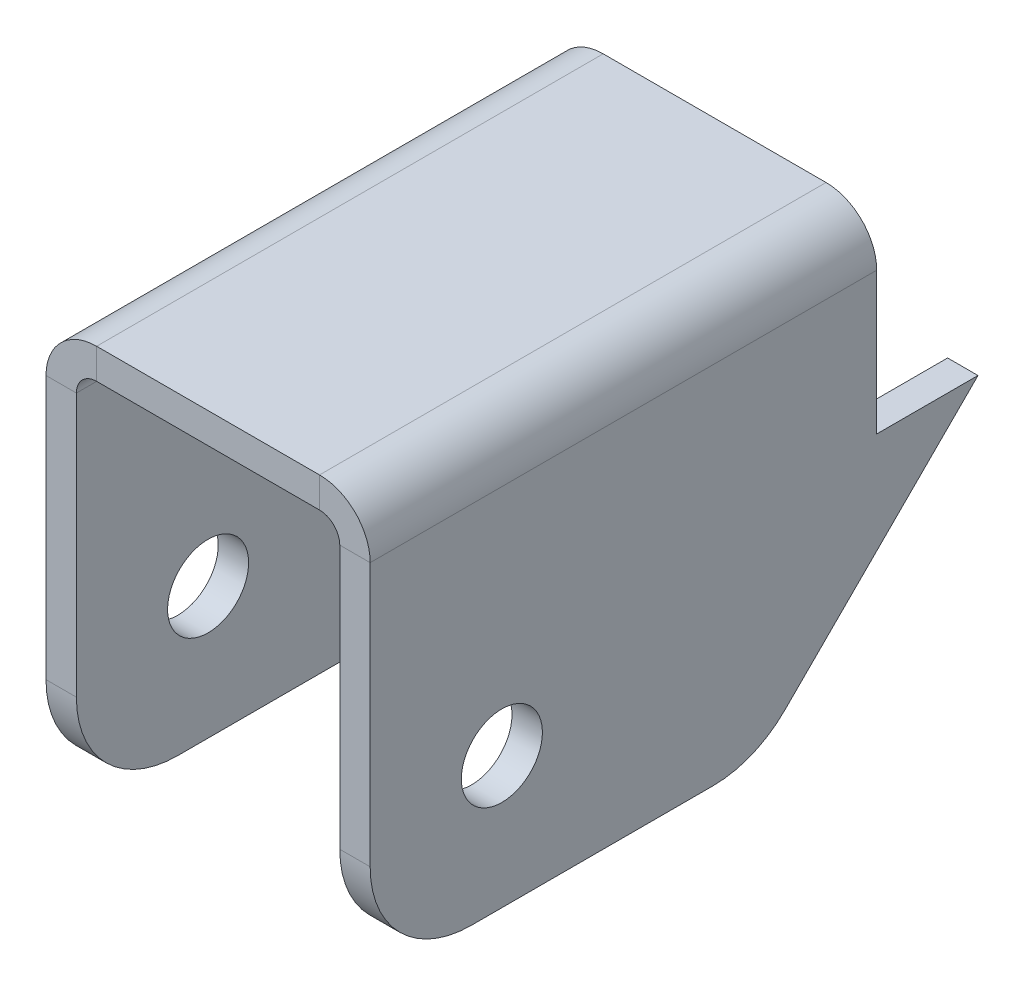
ISO-10303-21;
HEADER;
FILE_DESCRIPTION(('STEP AP214'),'2;1');
FILE_NAME('part.step','',(''),(''),'','','');
FILE_SCHEMA(('AUTOMOTIVE_DESIGN { 1 0 10303 214 1 1 1 1 }'));
ENDSEC;
DATA;
#1=APPLICATION_CONTEXT('core data for automotive mechanical design processes');
#2=APPLICATION_PROTOCOL_DEFINITION('international standard','automotive_design',2000,#1);
#3=PRODUCT_CONTEXT('',#1,'mechanical');
#4=PRODUCT('Part','Part','',(#3));
#5=PRODUCT_RELATED_PRODUCT_CATEGORY('part','',(#4));
#6=PRODUCT_DEFINITION_FORMATION('','',#4);
#7=PRODUCT_DEFINITION_CONTEXT('part definition',#1,'design');
#8=PRODUCT_DEFINITION('design','',#6,#7);
#9=PRODUCT_DEFINITION_SHAPE('','',#8);
#10=(LENGTH_UNIT() NAMED_UNIT(*) SI_UNIT(.MILLI.,.METRE.));
#11=(NAMED_UNIT(*) PLANE_ANGLE_UNIT() SI_UNIT($,.RADIAN.));
#12=(NAMED_UNIT(*) SI_UNIT($,.STERADIAN.) SOLID_ANGLE_UNIT());
#13=UNCERTAINTY_MEASURE_WITH_UNIT(LENGTH_MEASURE(1.E-05),#10,'distance_accuracy_value','');
#14=(GEOMETRIC_REPRESENTATION_CONTEXT(3) GLOBAL_UNCERTAINTY_ASSIGNED_CONTEXT((#13)) GLOBAL_UNIT_ASSIGNED_CONTEXT((#10,
#11,#12)) REPRESENTATION_CONTEXT('',''));
#15=CARTESIAN_POINT('',(0.,0.,0.));
#16=DIRECTION('',(0.,0.,1.));
#17=DIRECTION('',(1.,0.,0.));
#18=AXIS2_PLACEMENT_3D('',#15,#16,#17);
#19=CARTESIAN_POINT('',(13.,0.,60.));
#20=DIRECTION('',(1.,0.,0.));
#21=DIRECTION('',(0.,0.,-1.));
#22=AXIS2_PLACEMENT_3D('',#19,#20,#21);
#23=PLANE('',#22);
#24=CARTESIAN_POINT('',(13.,-28.,47.));
#25=DIRECTION('',(1.,0.,0.));
#26=DIRECTION('',(0.,0.,-1.));
#27=AXIS2_PLACEMENT_3D('',#24,#25,#26);
#28=CIRCLE('',#27,4.00000000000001);
#29=CARTESIAN_POINT('',(13.,-28.,43.));
#30=VERTEX_POINT('',#29);
#31=EDGE_CURVE('E366',#30,#30,#28,.T.);
#32=ORIENTED_EDGE('',*,*,#31,.T.);
#33=EDGE_LOOP('',(#32));
#34=FACE_BOUND('',#33,.T.);
#35=DIRECTION('',(0.,-0.707106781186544,0.707106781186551));
#36=VECTOR('',#35,1.);
#37=CARTESIAN_POINT('',(13.,-39.5000000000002,20.5000000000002));
#38=LINE('',#37,#36);
#39=CARTESIAN_POINT('',(13.,-19.,0.));
#40=VERTEX_POINT('',#39);
#41=CARTESIAN_POINT('',(13.,-38.0710678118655,19.0710678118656));
#42=VERTEX_POINT('',#41);
#43=EDGE_CURVE('E183',#40,#42,#38,.T.);
#44=ORIENTED_EDGE('',*,*,#43,.T.);
#45=CARTESIAN_POINT('',(13.,-31.,26.142135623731));
#46=DIRECTION('',(1.,0.,0.));
#47=DIRECTION('',(0.,0.,-1.));
#48=AXIS2_PLACEMENT_3D('',#45,#46,#47);
#49=CIRCLE('',#48,10.);
#50=CARTESIAN_POINT('',(13.,-41.,26.142135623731));
#51=VERTEX_POINT('',#50);
#52=EDGE_CURVE('E348',#42,#51,#49,.F.);
#53=ORIENTED_EDGE('',*,*,#52,.T.);
#54=DIRECTION('',(0.,0.,-1.));
#55=VECTOR('',#54,1.);
#56=CARTESIAN_POINT('',(13.,-41.,60.));
#57=LINE('',#56,#55);
#58=CARTESIAN_POINT('',(13.,-41.,50.));
#59=VERTEX_POINT('',#58);
#60=EDGE_CURVE('E301',#59,#51,#57,.T.);
#61=ORIENTED_EDGE('',*,*,#60,.F.);
#62=CARTESIAN_POINT('',(13.,-31.,50.));
#63=DIRECTION('',(1.,0.,0.));
#64=DIRECTION('',(0.,0.,-1.));
#65=AXIS2_PLACEMENT_3D('',#62,#63,#64);
#66=CIRCLE('',#65,10.);
#67=CARTESIAN_POINT('',(13.,-31.,60.));
#68=VERTEX_POINT('',#67);
#69=EDGE_CURVE('E325',#59,#68,#66,.F.);
#70=ORIENTED_EDGE('',*,*,#69,.T.);
#71=DIRECTION('',(0.,1.,0.));
#72=VECTOR('',#71,1.);
#73=CARTESIAN_POINT('',(13.,0.,60.));
#74=LINE('',#73,#72);
#75=CARTESIAN_POINT('',(13.,-4.99999999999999,60.));
#76=VERTEX_POINT('',#75);
#77=EDGE_CURVE('E243',#76,#68,#74,.F.);
#78=ORIENTED_EDGE('',*,*,#77,.F.);
#79=DIRECTION('',(0.,0.,-1.));
#80=VECTOR('',#79,1.);
#81=CARTESIAN_POINT('',(13.,-4.99999999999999,60.));
#82=LINE('',#81,#80);
#83=CARTESIAN_POINT('',(13.,-4.99999999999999,10.));
#84=VERTEX_POINT('',#83);
#85=EDGE_CURVE('E271',#76,#84,#82,.T.);
#86=ORIENTED_EDGE('',*,*,#85,.T.);
#87=DIRECTION('',(0.,-1.,0.));
#88=VECTOR('',#87,1.);
#89=CARTESIAN_POINT('',(13.,0.,10.));
#90=LINE('',#89,#88);
#91=CARTESIAN_POINT('',(13.,-19.,10.));
#92=VERTEX_POINT('',#91);
#93=EDGE_CURVE('E234',#84,#92,#90,.T.);
#94=ORIENTED_EDGE('',*,*,#93,.T.);
#95=DIRECTION('',(0.,0.,-1.));
#96=VECTOR('',#95,1.);
#97=CARTESIAN_POINT('',(13.,-19.,60.));
#98=LINE('',#97,#96);
#99=EDGE_CURVE('E223',#92,#40,#98,.T.);
#100=ORIENTED_EDGE('',*,*,#99,.T.);
#101=EDGE_LOOP('',(#44,#53,#61,#70,#78,#86,#94,#100));
#102=FACE_BOUND('',#101,.T.);
#103=ADVANCED_FACE('F39',(#34,#102),#23,.F.);
#104=CARTESIAN_POINT('',(16.,-41.,60.));
#105=DIRECTION('',(0.,-1.,0.));
#106=DIRECTION('',(0.,0.,-1.));
#107=AXIS2_PLACEMENT_3D('',#104,#105,#106);
#108=PLANE('',#107);
#109=ORIENTED_EDGE('',*,*,#60,.T.);
#110=DIRECTION('',(-1.,0.,0.));
#111=VECTOR('',#110,1.);
#112=CARTESIAN_POINT('',(16.,-41.,26.142135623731));
#113=LINE('',#112,#111);
#114=CARTESIAN_POINT('',(16.,-41.,26.142135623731));
#115=VERTEX_POINT('',#114);
#116=EDGE_CURVE('E342',#51,#115,#113,.F.);
#117=ORIENTED_EDGE('',*,*,#116,.T.);
#118=DIRECTION('',(0.,0.,-1.));
#119=VECTOR('',#118,1.);
#120=CARTESIAN_POINT('',(16.,-41.,60.));
#121=LINE('',#120,#119);
#122=CARTESIAN_POINT('',(16.,-41.,50.));
#123=VERTEX_POINT('',#122);
#124=EDGE_CURVE('E299',#123,#115,#121,.T.);
#125=ORIENTED_EDGE('',*,*,#124,.F.);
#126=DIRECTION('',(-1.,0.,0.));
#127=VECTOR('',#126,1.);
#128=CARTESIAN_POINT('',(16.,-41.,50.));
#129=LINE('',#128,#127);
#130=EDGE_CURVE('E322',#123,#59,#129,.T.);
#131=ORIENTED_EDGE('',*,*,#130,.T.);
#132=EDGE_LOOP('',(#109,#117,#125,#131));
#133=FACE_BOUND('',#132,.T.);
#134=ADVANCED_FACE('F396',(#133),#108,.T.);
#135=CARTESIAN_POINT('',(16.,0.,60.));
#136=DIRECTION('',(1.,0.,0.));
#137=DIRECTION('',(0.,0.,-1.));
#138=AXIS2_PLACEMENT_3D('',#135,#136,#137);
#139=PLANE('',#138);
#140=CARTESIAN_POINT('',(16.,-28.,47.));
#141=DIRECTION('',(-1.,0.,0.));
#142=DIRECTION('',(0.,-1.,0.));
#143=AXIS2_PLACEMENT_3D('',#140,#141,#142);
#144=CIRCLE('',#143,4.00000000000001);
#145=CARTESIAN_POINT('',(16.,-32.,47.));
#146=VERTEX_POINT('',#145);
#147=EDGE_CURVE('E373',#146,#146,#144,.T.);
#148=ORIENTED_EDGE('',*,*,#147,.T.);
#149=EDGE_LOOP('',(#148));
#150=FACE_BOUND('',#149,.T.);
#151=ORIENTED_EDGE('',*,*,#124,.T.);
#152=CARTESIAN_POINT('',(16.,-31.,26.142135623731));
#153=DIRECTION('',(1.,0.,0.));
#154=DIRECTION('',(0.,0.,-1.));
#155=AXIS2_PLACEMENT_3D('',#152,#153,#154);
#156=CIRCLE('',#155,10.);
#157=CARTESIAN_POINT('',(16.,-38.0710678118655,19.0710678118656));
#158=VERTEX_POINT('',#157);
#159=EDGE_CURVE('E196',#115,#158,#156,.T.);
#160=ORIENTED_EDGE('',*,*,#159,.T.);
#161=DIRECTION('',(0.,-0.707106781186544,0.707106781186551));
#162=VECTOR('',#161,1.);
#163=CARTESIAN_POINT('',(16.,-39.5000000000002,20.5000000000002));
#164=LINE('',#163,#162);
#165=CARTESIAN_POINT('',(16.,-19.,0.));
#166=VERTEX_POINT('',#165);
#167=EDGE_CURVE('E180',#166,#158,#164,.T.);
#168=ORIENTED_EDGE('',*,*,#167,.F.);
#169=DIRECTION('',(0.,0.,1.));
#170=VECTOR('',#169,1.);
#171=CARTESIAN_POINT('',(16.,-19.,0.));
#172=LINE('',#171,#170);
#173=CARTESIAN_POINT('',(16.,-19.,10.));
#174=VERTEX_POINT('',#173);
#175=EDGE_CURVE('E195',#166,#174,#172,.T.);
#176=ORIENTED_EDGE('',*,*,#175,.T.);
#177=DIRECTION('',(0.,1.,0.));
#178=VECTOR('',#177,1.);
#179=CARTESIAN_POINT('',(16.,0.,10.));
#180=LINE('',#179,#178);
#181=CARTESIAN_POINT('',(16.,-4.99999999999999,10.));
#182=VERTEX_POINT('',#181);
#183=EDGE_CURVE('E203',#174,#182,#180,.T.);
#184=ORIENTED_EDGE('',*,*,#183,.T.);
#185=DIRECTION('',(0.,0.,-1.));
#186=VECTOR('',#185,1.);
#187=CARTESIAN_POINT('',(16.,-4.99999999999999,60.));
#188=LINE('',#187,#186);
#189=CARTESIAN_POINT('',(16.,-4.99999999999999,60.));
#190=VERTEX_POINT('',#189);
#191=EDGE_CURVE('E296',#190,#182,#188,.T.);
#192=ORIENTED_EDGE('',*,*,#191,.F.);
#193=DIRECTION('',(0.,-1.,0.));
#194=VECTOR('',#193,1.);
#195=CARTESIAN_POINT('',(16.,0.,60.));
#196=LINE('',#195,#194);
#197=CARTESIAN_POINT('',(16.,-31.,60.));
#198=VERTEX_POINT('',#197);
#199=EDGE_CURVE('E246',#190,#198,#196,.T.);
#200=ORIENTED_EDGE('',*,*,#199,.T.);
#201=CARTESIAN_POINT('',(16.,-31.,50.));
#202=DIRECTION('',(1.,0.,0.));
#203=DIRECTION('',(0.,0.,-1.));
#204=AXIS2_PLACEMENT_3D('',#201,#202,#203);
#205=CIRCLE('',#204,10.);
#206=EDGE_CURVE('E329',#198,#123,#205,.T.);
#207=ORIENTED_EDGE('',*,*,#206,.T.);
#208=EDGE_LOOP('',(#151,#160,#168,#176,#184,#192,#200,#207));
#209=FACE_BOUND('',#208,.T.);
#210=ADVANCED_FACE('F193',(#150,#209),#139,.T.);
#211=CARTESIAN_POINT('',(-16.,-41.,60.));
#212=DIRECTION('',(-1.,0.,0.));
#213=DIRECTION('',(0.,-1.,0.));
#214=AXIS2_PLACEMENT_3D('',#211,#212,#213);
#215=PLANE('',#214);
#216=CARTESIAN_POINT('',(-16.,-28.,47.));
#217=DIRECTION('',(-1.,0.,0.));
#218=DIRECTION('',(0.,-1.,0.));
#219=AXIS2_PLACEMENT_3D('',#216,#217,#218);
#220=CIRCLE('',#219,4.00000000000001);
#221=CARTESIAN_POINT('',(-16.,-32.,47.));
#222=VERTEX_POINT('',#221);
#223=EDGE_CURVE('E370',#222,#222,#220,.T.);
#224=ORIENTED_EDGE('',*,*,#223,.F.);
#225=EDGE_LOOP('',(#224));
#226=FACE_BOUND('',#225,.T.);
#227=DIRECTION('',(0.,0.707106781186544,-0.707106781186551));
#228=VECTOR('',#227,1.);
#229=CARTESIAN_POINT('',(-16.,-60.,41.0000000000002));
#230=LINE('',#229,#228);
#231=CARTESIAN_POINT('',(-16.,-38.0710678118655,19.0710678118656));
#232=VERTEX_POINT('',#231);
#233=CARTESIAN_POINT('',(-16.,-19.,0.));
#234=VERTEX_POINT('',#233);
#235=EDGE_CURVE('E214',#232,#234,#230,.T.);
#236=ORIENTED_EDGE('',*,*,#235,.F.);
#237=CARTESIAN_POINT('',(-16.,-31.,26.142135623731));
#238=DIRECTION('',(-1.,0.,0.));
#239=DIRECTION('',(0.,-1.,0.));
#240=AXIS2_PLACEMENT_3D('',#237,#238,#239);
#241=CIRCLE('',#240,10.);
#242=CARTESIAN_POINT('',(-16.,-41.,26.142135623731));
#243=VERTEX_POINT('',#242);
#244=EDGE_CURVE('E62',#232,#243,#241,.T.);
#245=ORIENTED_EDGE('',*,*,#244,.T.);
#246=DIRECTION('',(0.,0.,-1.));
#247=VECTOR('',#246,1.);
#248=CARTESIAN_POINT('',(-16.,-41.,60.));
#249=LINE('',#248,#247);
#250=CARTESIAN_POINT('',(-16.,-41.,50.));
#251=VERTEX_POINT('',#250);
#252=EDGE_CURVE('E285',#251,#243,#249,.T.);
#253=ORIENTED_EDGE('',*,*,#252,.F.);
#254=CARTESIAN_POINT('',(-16.,-31.,50.));
#255=DIRECTION('',(-1.,0.,0.));
#256=DIRECTION('',(0.,-1.,0.));
#257=AXIS2_PLACEMENT_3D('',#254,#255,#256);
#258=CIRCLE('',#257,10.);
#259=CARTESIAN_POINT('',(-16.,-31.,60.));
#260=VERTEX_POINT('',#259);
#261=EDGE_CURVE('E316',#251,#260,#258,.T.);
#262=ORIENTED_EDGE('',*,*,#261,.T.);
#263=DIRECTION('',(0.,1.,0.));
#264=VECTOR('',#263,1.);
#265=CARTESIAN_POINT('',(-16.,-41.,60.));
#266=LINE('',#265,#264);
#267=CARTESIAN_POINT('',(-16.,-4.99999999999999,60.));
#268=VERTEX_POINT('',#267);
#269=EDGE_CURVE('E258',#260,#268,#266,.T.);
#270=ORIENTED_EDGE('',*,*,#269,.T.);
#271=DIRECTION('',(0.,0.,-1.));
#272=VECTOR('',#271,1.);
#273=CARTESIAN_POINT('',(-16.,-4.99999999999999,60.));
#274=LINE('',#273,#272);
#275=CARTESIAN_POINT('',(-16.,-4.99999999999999,10.));
#276=VERTEX_POINT('',#275);
#277=EDGE_CURVE('E287',#268,#276,#274,.T.);
#278=ORIENTED_EDGE('',*,*,#277,.T.);
#279=DIRECTION('',(0.,1.,0.));
#280=VECTOR('',#279,1.);
#281=CARTESIAN_POINT('',(-16.,0.,10.));
#282=LINE('',#281,#280);
#283=CARTESIAN_POINT('',(-16.,-19.,10.));
#284=VERTEX_POINT('',#283);
#285=EDGE_CURVE('E204',#284,#276,#282,.T.);
#286=ORIENTED_EDGE('',*,*,#285,.F.);
#287=DIRECTION('',(0.,0.,1.));
#288=VECTOR('',#287,1.);
#289=CARTESIAN_POINT('',(-16.,-19.,0.));
#290=LINE('',#289,#288);
#291=EDGE_CURVE('E208',#234,#284,#290,.T.);
#292=ORIENTED_EDGE('',*,*,#291,.F.);
#293=EDGE_LOOP('',(#236,#245,#253,#262,#270,#278,#286,#292));
#294=FACE_BOUND('',#293,.T.);
#295=ADVANCED_FACE('F363',(#226,#294),#215,.T.);
#296=CARTESIAN_POINT('',(-13.,-41.,60.));
#297=DIRECTION('',(0.,-1.,0.));
#298=DIRECTION('',(0.,0.,-1.));
#299=AXIS2_PLACEMENT_3D('',#296,#297,#298);
#300=PLANE('',#299);
#301=ORIENTED_EDGE('',*,*,#252,.T.);
#302=DIRECTION('',(1.,0.,0.));
#303=VECTOR('',#302,1.);
#304=CARTESIAN_POINT('',(-13.,-41.,26.142135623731));
#305=LINE('',#304,#303);
#306=CARTESIAN_POINT('',(-13.,-41.,26.142135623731));
#307=VERTEX_POINT('',#306);
#308=EDGE_CURVE('E48',#243,#307,#305,.T.);
#309=ORIENTED_EDGE('',*,*,#308,.T.);
#310=DIRECTION('',(0.,0.,-1.));
#311=VECTOR('',#310,1.);
#312=CARTESIAN_POINT('',(-13.,-41.,60.));
#313=LINE('',#312,#311);
#314=CARTESIAN_POINT('',(-13.,-41.,50.));
#315=VERTEX_POINT('',#314);
#316=EDGE_CURVE('E283',#315,#307,#313,.T.);
#317=ORIENTED_EDGE('',*,*,#316,.F.);
#318=DIRECTION('',(-1.,0.,0.));
#319=VECTOR('',#318,1.);
#320=CARTESIAN_POINT('',(-13.,-41.,50.));
#321=LINE('',#320,#319);
#322=EDGE_CURVE('E313',#315,#251,#321,.T.);
#323=ORIENTED_EDGE('',*,*,#322,.T.);
#324=EDGE_LOOP('',(#301,#309,#317,#323));
#325=FACE_BOUND('',#324,.T.);
#326=ADVANCED_FACE('F509',(#325),#300,.T.);
#327=CARTESIAN_POINT('',(-13.,-41.,60.));
#328=DIRECTION('',(-1.,0.,0.));
#329=DIRECTION('',(0.,-1.,0.));
#330=AXIS2_PLACEMENT_3D('',#327,#328,#329);
#331=PLANE('',#330);
#332=CARTESIAN_POINT('',(-13.,-28.,47.));
#333=DIRECTION('',(-1.,0.,0.));
#334=DIRECTION('',(0.,-1.,0.));
#335=AXIS2_PLACEMENT_3D('',#332,#333,#334);
#336=CIRCLE('',#335,4.00000000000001);
#337=CARTESIAN_POINT('',(-13.,-32.,47.));
#338=VERTEX_POINT('',#337);
#339=EDGE_CURVE('E43',#338,#338,#336,.T.);
#340=ORIENTED_EDGE('',*,*,#339,.T.);
#341=EDGE_LOOP('',(#340));
#342=FACE_BOUND('',#341,.T.);
#343=ORIENTED_EDGE('',*,*,#316,.T.);
#344=CARTESIAN_POINT('',(-13.,-31.,26.142135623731));
#345=DIRECTION('',(-1.,0.,0.));
#346=DIRECTION('',(0.,-1.,0.));
#347=AXIS2_PLACEMENT_3D('',#344,#345,#346);
#348=CIRCLE('',#347,10.);
#349=CARTESIAN_POINT('',(-13.,-38.0710678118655,19.0710678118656));
#350=VERTEX_POINT('',#349);
#351=EDGE_CURVE('E11',#307,#350,#348,.F.);
#352=ORIENTED_EDGE('',*,*,#351,.T.);
#353=DIRECTION('',(0.,0.707106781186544,-0.707106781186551));
#354=VECTOR('',#353,1.);
#355=CARTESIAN_POINT('',(-13.,-60.,41.0000000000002));
#356=LINE('',#355,#354);
#357=CARTESIAN_POINT('',(-13.,-19.,0.));
#358=VERTEX_POINT('',#357);
#359=EDGE_CURVE('E197',#350,#358,#356,.T.);
#360=ORIENTED_EDGE('',*,*,#359,.T.);
#361=DIRECTION('',(0.,0.,1.));
#362=VECTOR('',#361,1.);
#363=CARTESIAN_POINT('',(-13.,-19.,60.));
#364=LINE('',#363,#362);
#365=CARTESIAN_POINT('',(-13.,-19.,10.));
#366=VERTEX_POINT('',#365);
#367=EDGE_CURVE('E219',#358,#366,#364,.T.);
#368=ORIENTED_EDGE('',*,*,#367,.T.);
#369=DIRECTION('',(0.,1.,0.));
#370=VECTOR('',#369,1.);
#371=CARTESIAN_POINT('',(-13.,-41.,10.));
#372=LINE('',#371,#370);
#373=CARTESIAN_POINT('',(-13.,-4.99999999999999,10.));
#374=VERTEX_POINT('',#373);
#375=EDGE_CURVE('E231',#366,#374,#372,.T.);
#376=ORIENTED_EDGE('',*,*,#375,.T.);
#377=DIRECTION('',(0.,0.,-1.));
#378=VECTOR('',#377,1.);
#379=CARTESIAN_POINT('',(-13.,-4.99999999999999,60.));
#380=LINE('',#379,#378);
#381=CARTESIAN_POINT('',(-13.,-4.99999999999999,60.));
#382=VERTEX_POINT('',#381);
#383=EDGE_CURVE('E280',#382,#374,#380,.T.);
#384=ORIENTED_EDGE('',*,*,#383,.F.);
#385=DIRECTION('',(0.,1.,0.));
#386=VECTOR('',#385,1.);
#387=CARTESIAN_POINT('',(-13.,-41.,60.));
#388=LINE('',#387,#386);
#389=CARTESIAN_POINT('',(-13.,-31.,60.));
#390=VERTEX_POINT('',#389);
#391=EDGE_CURVE('E260',#390,#382,#388,.T.);
#392=ORIENTED_EDGE('',*,*,#391,.F.);
#393=CARTESIAN_POINT('',(-13.,-31.,50.));
#394=DIRECTION('',(-1.,0.,0.));
#395=DIRECTION('',(0.,-1.,0.));
#396=AXIS2_PLACEMENT_3D('',#393,#394,#395);
#397=CIRCLE('',#396,10.);
#398=EDGE_CURVE('E320',#390,#315,#397,.F.);
#399=ORIENTED_EDGE('',*,*,#398,.T.);
#400=EDGE_LOOP('',(#343,#352,#360,#368,#376,#384,#392,#399));
#401=FACE_BOUND('',#400,.T.);
#402=ADVANCED_FACE('F380',(#342,#401),#331,.F.);
#403=CARTESIAN_POINT('',(16.,0.,10.));
#404=DIRECTION('',(0.,0.,1.));
#405=DIRECTION('',(0.,-1.,0.));
#406=AXIS2_PLACEMENT_3D('',#403,#404,#405);
#407=PLANE('',#406);
#408=ORIENTED_EDGE('',*,*,#285,.T.);
#409=DIRECTION('',(1.,0.,0.));
#410=VECTOR('',#409,1.);
#411=CARTESIAN_POINT('',(-16.,-4.99999999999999,10.));
#412=LINE('',#411,#410);
#413=EDGE_CURVE('E340',#276,#374,#412,.T.);
#414=ORIENTED_EDGE('',*,*,#413,.T.);
#415=ORIENTED_EDGE('',*,*,#375,.F.);
#416=DIRECTION('',(-1.,0.,0.));
#417=VECTOR('',#416,1.);
#418=CARTESIAN_POINT('',(16.,-19.,10.));
#419=LINE('',#418,#417);
#420=EDGE_CURVE('E187',#366,#284,#419,.T.);
#421=ORIENTED_EDGE('',*,*,#420,.T.);
#422=EDGE_LOOP('',(#408,#414,#415,#421));
#423=FACE_BOUND('',#422,.T.);
#424=ADVANCED_FACE('F488',(#423),#407,.F.);
#425=DIRECTION('',(1.,0.,0.));
#426=VECTOR('',#425,1.);
#427=CARTESIAN_POINT('',(-16.,-3.,10.));
#428=LINE('',#427,#426);
#429=CARTESIAN_POINT('',(-11.,-3.,10.));
#430=VERTEX_POINT('',#429);
#431=CARTESIAN_POINT('',(11.,-3.,10.));
#432=VERTEX_POINT('',#431);
#433=EDGE_CURVE('E225',#430,#432,#428,.T.);
#434=ORIENTED_EDGE('',*,*,#433,.F.);
#435=DIRECTION('',(0.,1.,0.));
#436=VECTOR('',#435,1.);
#437=CARTESIAN_POINT('',(-11.,-3.,10.));
#438=LINE('',#437,#436);
#439=CARTESIAN_POINT('',(-11.,0.,10.));
#440=VERTEX_POINT('',#439);
#441=EDGE_CURVE('E338',#430,#440,#438,.T.);
#442=ORIENTED_EDGE('',*,*,#441,.T.);
#443=DIRECTION('',(-1.,0.,0.));
#444=VECTOR('',#443,1.);
#445=CARTESIAN_POINT('',(16.,0.,10.));
#446=LINE('',#445,#444);
#447=CARTESIAN_POINT('',(11.,0.,10.));
#448=VERTEX_POINT('',#447);
#449=EDGE_CURVE('E216',#448,#440,#446,.T.);
#450=ORIENTED_EDGE('',*,*,#449,.F.);
#451=DIRECTION('',(0.,-1.,0.));
#452=VECTOR('',#451,1.);
#453=CARTESIAN_POINT('',(11.,0.,10.));
#454=LINE('',#453,#452);
#455=EDGE_CURVE('E334',#448,#432,#454,.T.);
#456=ORIENTED_EDGE('',*,*,#455,.T.);
#457=EDGE_LOOP('',(#434,#442,#450,#456));
#458=FACE_BOUND('',#457,.T.);
#459=ADVANCED_FACE('F483',(#458),#407,.F.);
#460=ORIENTED_EDGE('',*,*,#93,.F.);
#461=DIRECTION('',(1.,0.,0.));
#462=VECTOR('',#461,1.);
#463=CARTESIAN_POINT('',(13.,-4.99999999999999,10.));
#464=LINE('',#463,#462);
#465=EDGE_CURVE('E336',#84,#182,#464,.T.);
#466=ORIENTED_EDGE('',*,*,#465,.T.);
#467=ORIENTED_EDGE('',*,*,#183,.F.);
#468=EDGE_CURVE('E201',#174,#92,#419,.T.);
#469=ORIENTED_EDGE('',*,*,#468,.T.);
#470=EDGE_LOOP('',(#460,#466,#467,#469));
#471=FACE_BOUND('',#470,.T.);
#472=ADVANCED_FACE('F457',(#471),#407,.F.);
#473=ORIENTED_EDGE('',*,*,#413,.F.);
#474=CARTESIAN_POINT('',(-11.,-4.99999999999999,10.));
#475=DIRECTION('',(0.,0.,1.));
#476=DIRECTION('',(0.,-1.,0.));
#477=AXIS2_PLACEMENT_3D('',#474,#475,#476);
#478=CIRCLE('',#477,4.99999999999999);
#479=EDGE_CURVE('E237',#276,#440,#478,.F.);
#480=ORIENTED_EDGE('',*,*,#479,.T.);
#481=ORIENTED_EDGE('',*,*,#441,.F.);
#482=CARTESIAN_POINT('',(-11.,-4.99999999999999,10.));
#483=DIRECTION('',(0.,0.,1.));
#484=DIRECTION('',(0.,-1.,0.));
#485=AXIS2_PLACEMENT_3D('',#482,#483,#484);
#486=CIRCLE('',#485,1.99999999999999);
#487=EDGE_CURVE('E228',#374,#430,#486,.F.);
#488=ORIENTED_EDGE('',*,*,#487,.F.);
#489=EDGE_LOOP('',(#473,#480,#481,#488));
#490=FACE_BOUND('',#489,.T.);
#491=ADVANCED_FACE('F423',(#490),#407,.F.);
#492=CARTESIAN_POINT('',(-11.,0.,60.));
#493=DIRECTION('',(0.,0.,1.));
#494=DIRECTION('',(1.,0.,0.));
#495=AXIS2_PLACEMENT_3D('',#492,#493,#494);
#496=PLANE('',#495);
#497=DIRECTION('',(0.,-1.,0.));
#498=VECTOR('',#497,1.);
#499=CARTESIAN_POINT('',(-11.,0.,60.));
#500=LINE('',#499,#498);
#501=CARTESIAN_POINT('',(-11.,0.,60.));
#502=VERTEX_POINT('',#501);
#503=CARTESIAN_POINT('',(-11.,-3.,60.));
#504=VERTEX_POINT('',#503);
#505=EDGE_CURVE('E311',#502,#504,#500,.T.);
#506=ORIENTED_EDGE('',*,*,#505,.F.);
#507=CARTESIAN_POINT('',(-11.,-4.99999999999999,60.));
#508=DIRECTION('',(0.,0.,1.));
#509=DIRECTION('',(1.,0.,0.));
#510=AXIS2_PLACEMENT_3D('',#507,#508,#509);
#511=CIRCLE('',#510,4.99999999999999);
#512=EDGE_CURVE('E255',#268,#502,#511,.F.);
#513=ORIENTED_EDGE('',*,*,#512,.F.);
#514=DIRECTION('',(-1.,0.,0.));
#515=VECTOR('',#514,1.);
#516=CARTESIAN_POINT('',(-13.,-4.99999999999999,60.));
#517=LINE('',#516,#515);
#518=EDGE_CURVE('E308',#382,#268,#517,.T.);
#519=ORIENTED_EDGE('',*,*,#518,.F.);
#520=CARTESIAN_POINT('',(-11.,-4.99999999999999,60.));
#521=DIRECTION('',(0.,0.,1.));
#522=DIRECTION('',(1.,0.,0.));
#523=AXIS2_PLACEMENT_3D('',#520,#521,#522);
#524=CIRCLE('',#523,1.99999999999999);
#525=EDGE_CURVE('E262',#382,#504,#524,.F.);
#526=ORIENTED_EDGE('',*,*,#525,.T.);
#527=EDGE_LOOP('',(#506,#513,#519,#526));
#528=FACE_BOUND('',#527,.T.);
#529=ADVANCED_FACE('F419',(#528),#496,.T.);
#530=CARTESIAN_POINT('',(-13.,-4.99999999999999,60.));
#531=DIRECTION('',(0.,0.,1.));
#532=DIRECTION('',(1.,0.,0.));
#533=AXIS2_PLACEMENT_3D('',#530,#531,#532);
#534=PLANE('',#533);
#535=DIRECTION('',(1.,0.,0.));
#536=VECTOR('',#535,1.);
#537=CARTESIAN_POINT('',(-16.,0.,60.));
#538=LINE('',#537,#536);
#539=CARTESIAN_POINT('',(11.,0.,60.));
#540=VERTEX_POINT('',#539);
#541=EDGE_CURVE('E252',#502,#540,#538,.T.);
#542=ORIENTED_EDGE('',*,*,#541,.F.);
#543=ORIENTED_EDGE('',*,*,#505,.T.);
#544=DIRECTION('',(1.,0.,0.));
#545=VECTOR('',#544,1.);
#546=CARTESIAN_POINT('',(-16.,-3.,60.));
#547=LINE('',#546,#545);
#548=CARTESIAN_POINT('',(11.,-3.,60.));
#549=VERTEX_POINT('',#548);
#550=EDGE_CURVE('E265',#504,#549,#547,.T.);
#551=ORIENTED_EDGE('',*,*,#550,.T.);
#552=DIRECTION('',(0.,1.,0.));
#553=VECTOR('',#552,1.);
#554=CARTESIAN_POINT('',(11.,-3.,60.));
#555=LINE('',#554,#553);
#556=EDGE_CURVE('E304',#549,#540,#555,.T.);
#557=ORIENTED_EDGE('',*,*,#556,.T.);
#558=EDGE_LOOP('',(#542,#543,#551,#557));
#559=FACE_BOUND('',#558,.T.);
#560=ADVANCED_FACE('F415',(#559),#534,.T.);
#561=CARTESIAN_POINT('',(16.,-4.99999999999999,60.));
#562=DIRECTION('',(0.,0.,1.));
#563=DIRECTION('',(1.,0.,0.));
#564=AXIS2_PLACEMENT_3D('',#561,#562,#563);
#565=PLANE('',#564);
#566=DIRECTION('',(-1.,0.,0.));
#567=VECTOR('',#566,1.);
#568=CARTESIAN_POINT('',(16.,-4.99999999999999,60.));
#569=LINE('',#568,#567);
#570=EDGE_CURVE('E306',#190,#76,#569,.T.);
#571=ORIENTED_EDGE('',*,*,#570,.F.);
#572=CARTESIAN_POINT('',(11.,-4.99999999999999,60.));
#573=DIRECTION('',(0.,0.,1.));
#574=DIRECTION('',(1.,0.,0.));
#575=AXIS2_PLACEMENT_3D('',#572,#573,#574);
#576=CIRCLE('',#575,4.99999999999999);
#577=EDGE_CURVE('E249',#540,#190,#576,.F.);
#578=ORIENTED_EDGE('',*,*,#577,.F.);
#579=ORIENTED_EDGE('',*,*,#556,.F.);
#580=CARTESIAN_POINT('',(11.,-4.99999999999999,60.));
#581=DIRECTION('',(0.,0.,1.));
#582=DIRECTION('',(1.,0.,0.));
#583=AXIS2_PLACEMENT_3D('',#580,#581,#582);
#584=CIRCLE('',#583,1.99999999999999);
#585=EDGE_CURVE('E268',#549,#76,#584,.F.);
#586=ORIENTED_EDGE('',*,*,#585,.T.);
#587=EDGE_LOOP('',(#571,#578,#579,#586));
#588=FACE_BOUND('',#587,.T.);
#589=ADVANCED_FACE('F411',(#588),#565,.T.);
#590=CARTESIAN_POINT('',(11.,-3.,60.));
#591=DIRECTION('',(0.,0.,1.));
#592=DIRECTION('',(1.,0.,0.));
#593=AXIS2_PLACEMENT_3D('',#590,#591,#592);
#594=PLANE('',#593);
#595=ORIENTED_EDGE('',*,*,#77,.T.);
#596=DIRECTION('',(-1.,0.,0.));
#597=VECTOR('',#596,1.);
#598=CARTESIAN_POINT('',(11.,-31.,60.));
#599=LINE('',#598,#597);
#600=EDGE_CURVE('E327',#68,#198,#599,.F.);
#601=ORIENTED_EDGE('',*,*,#600,.T.);
#602=ORIENTED_EDGE('',*,*,#199,.F.);
#603=ORIENTED_EDGE('',*,*,#570,.T.);
#604=EDGE_LOOP('',(#595,#601,#602,#603));
#605=FACE_BOUND('',#604,.T.);
#606=ADVANCED_FACE('F407',(#605),#594,.T.);
#607=CARTESIAN_POINT('',(11.,-4.99999999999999,60.));
#608=DIRECTION('',(0.,0.,-1.));
#609=DIRECTION('',(-1.,0.,0.));
#610=AXIS2_PLACEMENT_3D('',#607,#608,#609);
#611=CYLINDRICAL_SURFACE('',#610,4.99999999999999);
#612=CARTESIAN_POINT('',(11.,-4.99999999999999,10.));
#613=DIRECTION('',(0.,0.,1.));
#614=DIRECTION('',(0.,-1.,0.));
#615=AXIS2_PLACEMENT_3D('',#612,#613,#614);
#616=CIRCLE('',#615,4.99999999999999);
#617=EDGE_CURVE('E240',#448,#182,#616,.F.);
#618=ORIENTED_EDGE('',*,*,#617,.F.);
#619=DIRECTION('',(0.,0.,-1.));
#620=VECTOR('',#619,1.);
#621=CARTESIAN_POINT('',(11.,0.,60.));
#622=LINE('',#621,#620);
#623=EDGE_CURVE('E293',#540,#448,#622,.T.);
#624=ORIENTED_EDGE('',*,*,#623,.F.);
#625=ORIENTED_EDGE('',*,*,#577,.T.);
#626=ORIENTED_EDGE('',*,*,#191,.T.);
#627=EDGE_LOOP('',(#618,#624,#625,#626));
#628=FACE_BOUND('',#627,.T.);
#629=ADVANCED_FACE('F410',(#628),#611,.T.);
#630=CARTESIAN_POINT('',(-16.,0.,60.));
#631=DIRECTION('',(0.,1.,0.));
#632=DIRECTION('',(-1.,0.,0.));
#633=AXIS2_PLACEMENT_3D('',#630,#631,#632);
#634=PLANE('',#633);
#635=ORIENTED_EDGE('',*,*,#449,.T.);
#636=DIRECTION('',(0.,0.,-1.));
#637=VECTOR('',#636,1.);
#638=CARTESIAN_POINT('',(-11.,0.,60.));
#639=LINE('',#638,#637);
#640=EDGE_CURVE('E290',#502,#440,#639,.T.);
#641=ORIENTED_EDGE('',*,*,#640,.F.);
#642=ORIENTED_EDGE('',*,*,#541,.T.);
#643=ORIENTED_EDGE('',*,*,#623,.T.);
#644=EDGE_LOOP('',(#635,#641,#642,#643));
#645=FACE_BOUND('',#644,.T.);
#646=ADVANCED_FACE('F464',(#645),#634,.T.);
#647=CARTESIAN_POINT('',(-11.,-4.99999999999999,60.));
#648=DIRECTION('',(0.,0.,-1.));
#649=DIRECTION('',(-1.,0.,0.));
#650=AXIS2_PLACEMENT_3D('',#647,#648,#649);
#651=CYLINDRICAL_SURFACE('',#650,4.99999999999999);
#652=ORIENTED_EDGE('',*,*,#479,.F.);
#653=ORIENTED_EDGE('',*,*,#277,.F.);
#654=ORIENTED_EDGE('',*,*,#512,.T.);
#655=ORIENTED_EDGE('',*,*,#640,.T.);
#656=EDGE_LOOP('',(#652,#653,#654,#655));
#657=FACE_BOUND('',#656,.T.);
#658=ADVANCED_FACE('F469',(#657),#651,.T.);
#659=CARTESIAN_POINT('',(-11.,-4.99999999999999,60.));
#660=DIRECTION('',(0.,0.,-1.));
#661=DIRECTION('',(-1.,0.,0.));
#662=AXIS2_PLACEMENT_3D('',#659,#660,#661);
#663=CYLINDRICAL_SURFACE('',#662,1.99999999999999);
#664=ORIENTED_EDGE('',*,*,#383,.T.);
#665=ORIENTED_EDGE('',*,*,#487,.T.);
#666=DIRECTION('',(0.,0.,-1.));
#667=VECTOR('',#666,1.);
#668=CARTESIAN_POINT('',(-11.,-3.,60.));
#669=LINE('',#668,#667);
#670=EDGE_CURVE('E277',#504,#430,#669,.T.);
#671=ORIENTED_EDGE('',*,*,#670,.F.);
#672=ORIENTED_EDGE('',*,*,#525,.F.);
#673=EDGE_LOOP('',(#664,#665,#671,#672));
#674=FACE_BOUND('',#673,.T.);
#675=ADVANCED_FACE('F476',(#674),#663,.F.);
#676=CARTESIAN_POINT('',(-16.,-3.,60.));
#677=DIRECTION('',(0.,1.,0.));
#678=DIRECTION('',(-1.,0.,0.));
#679=AXIS2_PLACEMENT_3D('',#676,#677,#678);
#680=PLANE('',#679);
#681=ORIENTED_EDGE('',*,*,#670,.T.);
#682=ORIENTED_EDGE('',*,*,#433,.T.);
#683=DIRECTION('',(0.,0.,-1.));
#684=VECTOR('',#683,1.);
#685=CARTESIAN_POINT('',(11.,-3.,60.));
#686=LINE('',#685,#684);
#687=EDGE_CURVE('E274',#549,#432,#686,.T.);
#688=ORIENTED_EDGE('',*,*,#687,.F.);
#689=ORIENTED_EDGE('',*,*,#550,.F.);
#690=EDGE_LOOP('',(#681,#682,#688,#689));
#691=FACE_BOUND('',#690,.T.);
#692=ADVANCED_FACE('F480',(#691),#680,.F.);
#693=CARTESIAN_POINT('',(11.,-4.99999999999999,60.));
#694=DIRECTION('',(0.,0.,-1.));
#695=DIRECTION('',(-1.,0.,0.));
#696=AXIS2_PLACEMENT_3D('',#693,#694,#695);
#697=CYLINDRICAL_SURFACE('',#696,1.99999999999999);
#698=ORIENTED_EDGE('',*,*,#687,.T.);
#699=CARTESIAN_POINT('',(11.,-4.99999999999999,10.));
#700=DIRECTION('',(0.,0.,1.));
#701=DIRECTION('',(0.,-1.,0.));
#702=AXIS2_PLACEMENT_3D('',#699,#700,#701);
#703=CIRCLE('',#702,1.99999999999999);
#704=EDGE_CURVE('E331',#432,#84,#703,.F.);
#705=ORIENTED_EDGE('',*,*,#704,.T.);
#706=ORIENTED_EDGE('',*,*,#85,.F.);
#707=ORIENTED_EDGE('',*,*,#585,.F.);
#708=EDGE_LOOP('',(#698,#705,#706,#707));
#709=FACE_BOUND('',#708,.T.);
#710=ADVANCED_FACE('F453',(#709),#697,.F.);
#711=CARTESIAN_POINT('',(11.,-4.99999999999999,60.));
#712=DIRECTION('',(0.,0.,1.));
#713=DIRECTION('',(1.,0.,0.));
#714=AXIS2_PLACEMENT_3D('',#711,#712,#713);
#715=PLANE('',#714);
#716=ORIENTED_EDGE('',*,*,#269,.F.);
#717=DIRECTION('',(-1.,0.,0.));
#718=VECTOR('',#717,1.);
#719=CARTESIAN_POINT('',(11.,-31.,60.));
#720=LINE('',#719,#718);
#721=EDGE_CURVE('E318',#260,#390,#720,.F.);
#722=ORIENTED_EDGE('',*,*,#721,.T.);
#723=ORIENTED_EDGE('',*,*,#391,.T.);
#724=ORIENTED_EDGE('',*,*,#518,.T.);
#725=EDGE_LOOP('',(#716,#722,#723,#724));
#726=FACE_BOUND('',#725,.T.);
#727=ADVANCED_FACE('F429',(#726),#715,.T.);
#728=CARTESIAN_POINT('',(-13.,-31.,50.));
#729=DIRECTION('',(-1.,0.,0.));
#730=DIRECTION('',(0.,0.,1.));
#731=AXIS2_PLACEMENT_3D('',#728,#729,#730);
#732=CYLINDRICAL_SURFACE('',#731,10.);
#733=ORIENTED_EDGE('',*,*,#398,.F.);
#734=ORIENTED_EDGE('',*,*,#721,.F.);
#735=ORIENTED_EDGE('',*,*,#261,.F.);
#736=ORIENTED_EDGE('',*,*,#322,.F.);
#737=EDGE_LOOP('',(#733,#734,#735,#736));
#738=FACE_BOUND('',#737,.T.);
#739=ADVANCED_FACE('F425',(#738),#732,.T.);
#740=CARTESIAN_POINT('',(16.,-31.,50.));
#741=DIRECTION('',(-1.,0.,0.));
#742=DIRECTION('',(0.,0.,1.));
#743=AXIS2_PLACEMENT_3D('',#740,#741,#742);
#744=CYLINDRICAL_SURFACE('',#743,10.);
#745=ORIENTED_EDGE('',*,*,#206,.F.);
#746=ORIENTED_EDGE('',*,*,#600,.F.);
#747=ORIENTED_EDGE('',*,*,#69,.F.);
#748=ORIENTED_EDGE('',*,*,#130,.F.);
#749=EDGE_LOOP('',(#745,#746,#747,#748));
#750=FACE_BOUND('',#749,.T.);
#751=ADVANCED_FACE('F428',(#750),#744,.T.);
#752=ORIENTED_EDGE('',*,*,#465,.F.);
#753=ORIENTED_EDGE('',*,*,#704,.F.);
#754=ORIENTED_EDGE('',*,*,#455,.F.);
#755=ORIENTED_EDGE('',*,*,#617,.T.);
#756=EDGE_LOOP('',(#752,#753,#754,#755));
#757=FACE_BOUND('',#756,.T.);
#758=ADVANCED_FACE('F432',(#757),#407,.F.);
#759=CARTESIAN_POINT('',(16.,-19.,0.));
#760=DIRECTION('',(0.,-1.,0.));
#761=DIRECTION('',(1.,0.,0.));
#762=AXIS2_PLACEMENT_3D('',#759,#760,#761);
#763=PLANE('',#762);
#764=ORIENTED_EDGE('',*,*,#468,.F.);
#765=ORIENTED_EDGE('',*,*,#175,.F.);
#766=DIRECTION('',(-1.,0.,0.));
#767=VECTOR('',#766,1.);
#768=CARTESIAN_POINT('',(16.,-19.,0.));
#769=LINE('',#768,#767);
#770=EDGE_CURVE('E177',#166,#40,#769,.T.);
#771=ORIENTED_EDGE('',*,*,#770,.T.);
#772=ORIENTED_EDGE('',*,*,#99,.F.);
#773=EDGE_LOOP('',(#764,#765,#771,#772));
#774=FACE_BOUND('',#773,.T.);
#775=ADVANCED_FACE('F199',(#774),#763,.F.);
#776=EDGE_CURVE('E188',#358,#234,#769,.T.);
#777=ORIENTED_EDGE('',*,*,#776,.T.);
#778=ORIENTED_EDGE('',*,*,#291,.T.);
#779=ORIENTED_EDGE('',*,*,#420,.F.);
#780=ORIENTED_EDGE('',*,*,#367,.F.);
#781=EDGE_LOOP('',(#777,#778,#779,#780));
#782=FACE_BOUND('',#781,.T.);
#783=ADVANCED_FACE('F492',(#782),#763,.F.);
#784=CARTESIAN_POINT('',(-13.,-60.,41.0000000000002));
#785=DIRECTION('',(0.,0.707106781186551,0.707106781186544));
#786=DIRECTION('',(0.,0.707106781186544,-0.707106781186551));
#787=AXIS2_PLACEMENT_3D('',#784,#785,#786);
#788=PLANE('',#787);
#789=ORIENTED_EDGE('',*,*,#359,.F.);
#790=DIRECTION('',(-1.,0.,0.));
#791=VECTOR('',#790,1.);
#792=CARTESIAN_POINT('',(-13.,-38.0710678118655,19.0710678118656));
#793=LINE('',#792,#791);
#794=EDGE_CURVE('E350',#350,#232,#793,.T.);
#795=ORIENTED_EDGE('',*,*,#794,.T.);
#796=ORIENTED_EDGE('',*,*,#235,.T.);
#797=ORIENTED_EDGE('',*,*,#776,.F.);
#798=EDGE_LOOP('',(#789,#795,#796,#797));
#799=FACE_BOUND('',#798,.T.);
#800=ADVANCED_FACE('F357',(#799),#788,.F.);
#801=CARTESIAN_POINT('',(13.,-39.5000000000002,20.5000000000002));
#802=DIRECTION('',(0.,0.707106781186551,0.707106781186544));
#803=DIRECTION('',(0.,-0.707106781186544,0.707106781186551));
#804=AXIS2_PLACEMENT_3D('',#801,#802,#803);
#805=PLANE('',#804);
#806=ORIENTED_EDGE('',*,*,#167,.T.);
#807=DIRECTION('',(1.,0.,0.));
#808=VECTOR('',#807,1.);
#809=CARTESIAN_POINT('',(13.,-38.0710678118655,19.0710678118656));
#810=LINE('',#809,#808);
#811=EDGE_CURVE('E346',#158,#42,#810,.F.);
#812=ORIENTED_EDGE('',*,*,#811,.T.);
#813=ORIENTED_EDGE('',*,*,#43,.F.);
#814=ORIENTED_EDGE('',*,*,#770,.F.);
#815=EDGE_LOOP('',(#806,#812,#813,#814));
#816=FACE_BOUND('',#815,.T.);
#817=ADVANCED_FACE('F179',(#816),#805,.F.);
#818=CARTESIAN_POINT('',(16.,-31.,26.142135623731));
#819=DIRECTION('',(-1.,0.,0.));
#820=DIRECTION('',(0.,0.,1.));
#821=AXIS2_PLACEMENT_3D('',#818,#819,#820);
#822=CYLINDRICAL_SURFACE('',#821,10.);
#823=ORIENTED_EDGE('',*,*,#52,.F.);
#824=ORIENTED_EDGE('',*,*,#811,.F.);
#825=ORIENTED_EDGE('',*,*,#159,.F.);
#826=ORIENTED_EDGE('',*,*,#116,.F.);
#827=EDGE_LOOP('',(#823,#824,#825,#826));
#828=FACE_BOUND('',#827,.T.);
#829=ADVANCED_FACE('F393',(#828),#822,.T.);
#830=CARTESIAN_POINT('',(-13.,-31.,26.142135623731));
#831=DIRECTION('',(1.,0.,0.));
#832=DIRECTION('',(0.,0.,-1.));
#833=AXIS2_PLACEMENT_3D('',#830,#831,#832);
#834=CYLINDRICAL_SURFACE('',#833,10.);
#835=ORIENTED_EDGE('',*,*,#351,.F.);
#836=ORIENTED_EDGE('',*,*,#308,.F.);
#837=ORIENTED_EDGE('',*,*,#244,.F.);
#838=ORIENTED_EDGE('',*,*,#794,.F.);
#839=EDGE_LOOP('',(#835,#836,#837,#838));
#840=FACE_BOUND('',#839,.T.);
#841=ADVANCED_FACE('F41',(#840),#834,.T.);
#842=CARTESIAN_POINT('',(16.,-28.,47.));
#843=DIRECTION('',(-1.,0.,0.));
#844=DIRECTION('',(0.,-1.,0.));
#845=AXIS2_PLACEMENT_3D('',#842,#843,#844);
#846=CYLINDRICAL_SURFACE('',#845,4.00000000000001);
#847=ORIENTED_EDGE('',*,*,#223,.T.);
#848=EDGE_LOOP('',(#847));
#849=FACE_BOUND('',#848,.T.);
#850=ORIENTED_EDGE('',*,*,#339,.F.);
#851=EDGE_LOOP('',(#850));
#852=FACE_BOUND('',#851,.T.);
#853=ADVANCED_FACE('F383',(#849,#852),#846,.F.);
#854=ORIENTED_EDGE('',*,*,#147,.F.);
#855=EDGE_LOOP('',(#854));
#856=FACE_BOUND('',#855,.T.);
#857=ORIENTED_EDGE('',*,*,#31,.F.);
#858=EDGE_LOOP('',(#857));
#859=FACE_BOUND('',#858,.T.);
#860=ADVANCED_FACE('F385',(#856,#859),#846,.F.);
#861=CLOSED_SHELL('',(#103,#134,#210,#295,#326,#402,#424,#459,#472,#491,#529,#560,#589,#606,
#629,#646,#658,#675,#692,#710,#727,#739,#751,#758,#775,#783,#800,#817,#829,#841,#853,#860));
#862=MANIFOLD_SOLID_BREP('B2',#861);
#863=ADVANCED_BREP_SHAPE_REPRESENTATION('',(#18,#862),#14);
#864=SHAPE_DEFINITION_REPRESENTATION(#9,#863);
ENDSEC;
END-ISO-10303-21;
